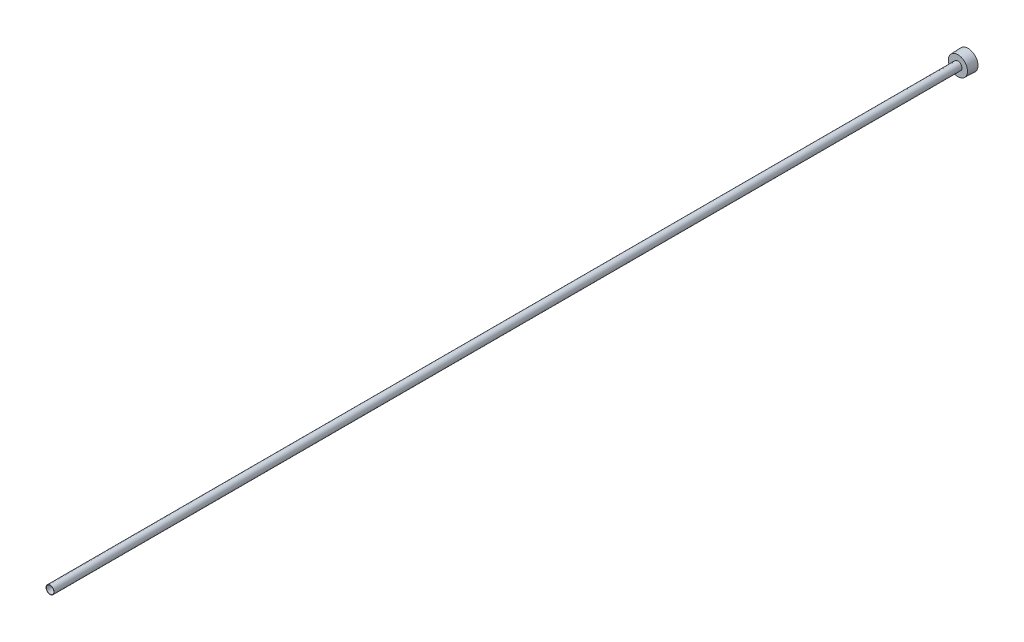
ISO-10303-21;
HEADER;
FILE_DESCRIPTION(('STEP AP214'),'2;1');
FILE_NAME('part.step','',(''),(''),'','','');
FILE_SCHEMA(('AUTOMOTIVE_DESIGN { 1 0 10303 214 1 1 1 1 }'));
ENDSEC;
DATA;
#1=APPLICATION_CONTEXT('core data for automotive mechanical design processes');
#2=APPLICATION_PROTOCOL_DEFINITION('international standard','automotive_design',2000,#1);
#3=PRODUCT_CONTEXT('',#1,'mechanical');
#4=PRODUCT('Part','Part','',(#3));
#5=PRODUCT_RELATED_PRODUCT_CATEGORY('part','',(#4));
#6=PRODUCT_DEFINITION_FORMATION('','',#4);
#7=PRODUCT_DEFINITION_CONTEXT('part definition',#1,'design');
#8=PRODUCT_DEFINITION('design','',#6,#7);
#9=PRODUCT_DEFINITION_SHAPE('','',#8);
#10=(LENGTH_UNIT() NAMED_UNIT(*) SI_UNIT(.MILLI.,.METRE.));
#11=(NAMED_UNIT(*) PLANE_ANGLE_UNIT() SI_UNIT($,.RADIAN.));
#12=(NAMED_UNIT(*) SI_UNIT($,.STERADIAN.) SOLID_ANGLE_UNIT());
#13=UNCERTAINTY_MEASURE_WITH_UNIT(LENGTH_MEASURE(1.E-05),#10,'distance_accuracy_value','');
#14=(GEOMETRIC_REPRESENTATION_CONTEXT(3) GLOBAL_UNCERTAINTY_ASSIGNED_CONTEXT((#13)) GLOBAL_UNIT_ASSIGNED_CONTEXT((#10,
#11,#12)) REPRESENTATION_CONTEXT('',''));
#15=CARTESIAN_POINT('',(0.,0.,0.));
#16=DIRECTION('',(0.,0.,1.));
#17=DIRECTION('',(1.,0.,0.));
#18=AXIS2_PLACEMENT_3D('',#15,#16,#17);
#19=CARTESIAN_POINT('',(0.,0.,0.));
#20=DIRECTION('',(0.,0.,1.));
#21=DIRECTION('',(1.,0.,0.));
#22=AXIS2_PLACEMENT_3D('',#19,#20,#21);
#23=CYLINDRICAL_SURFACE('',#22,5.0419);
#24=CARTESIAN_POINT('',(0.,0.,1219.2));
#25=DIRECTION('',(0.,0.,1.));
#26=DIRECTION('',(1.,0.,0.));
#27=AXIS2_PLACEMENT_3D('',#24,#25,#26);
#28=CIRCLE('',#27,5.0419);
#29=CARTESIAN_POINT('',(5.0419,0.,1219.2));
#30=VERTEX_POINT('',#29);
#31=EDGE_CURVE('E141',#30,#30,#28,.T.);
#32=CARTESIAN_POINT('',(0.,0.,9.525));
#33=DIRECTION('',(0.,0.,-1.));
#34=DIRECTION('',(-1.,0.,0.));
#35=AXIS2_PLACEMENT_3D('',#32,#33,#34);
#36=CIRCLE('',#35,5.0419);
#37=CARTESIAN_POINT('',(5.0419,0.,9.525));
#38=VERTEX_POINT('',#37);
#39=EDGE_CURVE('E36',#38,#38,#36,.F.);
#40=CARTESIAN_POINT('',(5.0419,0.,1219.2));
#41=CARTESIAN_POINT('',(5.0419,0.,1206.59921875));
#42=CARTESIAN_POINT('',(5.0419,0.,1193.9984375));
#43=CARTESIAN_POINT('',(5.0419,0.,1168.796875));
#44=CARTESIAN_POINT('',(5.0419,0.,1156.19609375));
#45=CARTESIAN_POINT('',(5.0419,0.,1130.99453125));
#46=CARTESIAN_POINT('',(5.0419,0.,1118.39375));
#47=CARTESIAN_POINT('',(5.0419,0.,1093.1921875));
#48=CARTESIAN_POINT('',(5.0419,0.,1080.59140625));
#49=CARTESIAN_POINT('',(5.0419,0.,1055.38984375));
#50=CARTESIAN_POINT('',(5.0419,0.,1042.7890625));
#51=CARTESIAN_POINT('',(5.0419,0.,1017.5875));
#52=CARTESIAN_POINT('',(5.0419,0.,1004.98671875));
#53=CARTESIAN_POINT('',(5.0419,0.,979.78515625));
#54=CARTESIAN_POINT('',(5.0419,0.,967.184375));
#55=CARTESIAN_POINT('',(5.0419,0.,941.9828125));
#56=CARTESIAN_POINT('',(5.0419,0.,929.38203125));
#57=CARTESIAN_POINT('',(5.0419,0.,904.18046875));
#58=CARTESIAN_POINT('',(5.0419,0.,891.5796875));
#59=CARTESIAN_POINT('',(5.0419,0.,866.378125));
#60=CARTESIAN_POINT('',(5.0419,0.,853.77734375));
#61=CARTESIAN_POINT('',(5.0419,0.,828.57578125));
#62=CARTESIAN_POINT('',(5.0419,0.,815.975));
#63=CARTESIAN_POINT('',(5.0419,0.,790.7734375));
#64=CARTESIAN_POINT('',(5.0419,0.,778.17265625));
#65=CARTESIAN_POINT('',(5.0419,0.,752.97109375));
#66=CARTESIAN_POINT('',(5.0419,0.,740.3703125));
#67=CARTESIAN_POINT('',(5.0419,0.,715.16875));
#68=CARTESIAN_POINT('',(5.0419,0.,702.56796875));
#69=CARTESIAN_POINT('',(5.0419,0.,677.36640625));
#70=CARTESIAN_POINT('',(5.0419,0.,664.765625));
#71=CARTESIAN_POINT('',(5.0419,0.,639.5640625));
#72=CARTESIAN_POINT('',(5.0419,0.,626.96328125));
#73=CARTESIAN_POINT('',(5.0419,0.,601.76171875));
#74=CARTESIAN_POINT('',(5.0419,0.,589.1609375));
#75=CARTESIAN_POINT('',(5.0419,0.,563.959375));
#76=CARTESIAN_POINT('',(5.0419,0.,551.35859375));
#77=CARTESIAN_POINT('',(5.0419,0.,526.15703125));
#78=CARTESIAN_POINT('',(5.0419,0.,513.55625));
#79=CARTESIAN_POINT('',(5.0419,0.,488.3546875));
#80=CARTESIAN_POINT('',(5.0419,0.,475.75390625));
#81=CARTESIAN_POINT('',(5.0419,0.,450.55234375));
#82=CARTESIAN_POINT('',(5.0419,0.,437.9515625));
#83=CARTESIAN_POINT('',(5.0419,0.,412.75));
#84=CARTESIAN_POINT('',(5.0419,0.,400.14921875));
#85=CARTESIAN_POINT('',(5.0419,0.,374.94765625));
#86=CARTESIAN_POINT('',(5.0419,0.,362.346875));
#87=CARTESIAN_POINT('',(5.0419,0.,337.1453125));
#88=CARTESIAN_POINT('',(5.0419,0.,324.54453125));
#89=CARTESIAN_POINT('',(5.0419,0.,299.34296875));
#90=CARTESIAN_POINT('',(5.0419,0.,286.7421875));
#91=CARTESIAN_POINT('',(5.0419,0.,261.540625));
#92=CARTESIAN_POINT('',(5.0419,0.,248.93984375));
#93=CARTESIAN_POINT('',(5.0419,0.,223.73828125));
#94=CARTESIAN_POINT('',(5.0419,0.,211.1375));
#95=CARTESIAN_POINT('',(5.0419,0.,185.9359375));
#96=CARTESIAN_POINT('',(5.0419,0.,173.33515625));
#97=CARTESIAN_POINT('',(5.0419,0.,148.13359375));
#98=CARTESIAN_POINT('',(5.0419,0.,135.5328125));
#99=CARTESIAN_POINT('',(5.0419,0.,110.33125));
#100=CARTESIAN_POINT('',(5.0419,0.,97.73046875));
#101=CARTESIAN_POINT('',(5.0419,0.,72.52890625));
#102=CARTESIAN_POINT('',(5.0419,0.,59.928125));
#103=CARTESIAN_POINT('',(5.0419,0.,34.7265624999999));
#104=CARTESIAN_POINT('',(5.0419,0.,22.12578125));
#105=CARTESIAN_POINT('',(5.0419,0.,9.525));
#106=B_SPLINE_CURVE_WITH_KNOTS('',3,(#40,#41,#42,#43,#44,#45,#46,#47,#48,#49,#50,#51,#52,#53,
#54,#55,#56,#57,#58,#59,#60,#61,#62,#63,#64,#65,#66,#67,#68,#69,#70,#71,#72,#73,#74,#75,#76,#77,
#78,#79,#80,#81,#82,#83,#84,#85,#86,#87,#88,#89,#90,#91,#92,#93,#94,#95,#96,#97,#98,#99,#100,
#101,#102,#103,#104,#105),.UNSPECIFIED.,.F.,.F.,(4,2,2,2,2,2,2,2,2,2,2,2,2,2,2,2,2,2,2,2,2,2,2,
2,2,2,2,2,2,2,2,2,4),(0.,37.8023437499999,75.6046875,113.40703125,151.209375,189.01171875,
226.8140625,264.61640625,302.41875,340.22109375,378.0234375,415.82578125,453.628125,
491.43046875,529.2328125,567.03515625,604.8375,642.63984375,680.4421875,718.24453125,756.046875,
793.84921875,831.6515625,869.45390625,907.25625,945.05859375,982.8609375,1020.66328125,
1058.465625,1096.26796875,1134.0703125,1171.87265625,1209.675),.UNSPECIFIED.);
#107=EDGE_CURVE('BSEAM32',#30,#38,#106,.T.);
#108=ORIENTED_EDGE('',*,*,#31,.T.);
#109=ORIENTED_EDGE('',*,*,#39,.F.);
#110=ORIENTED_EDGE('',*,*,#107,.T.);
#111=ORIENTED_EDGE('',*,*,#107,.F.);
#112=EDGE_LOOP('',(#108,#110,#109,#111));
#113=FACE_BOUND('',#112,.T.);
#114=ADVANCED_FACE('F32',(#113),#23,.F.);
#115=CARTESIAN_POINT('',(0.,5.42289999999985,1219.2));
#116=DIRECTION('',(0.,0.,-1.));
#117=DIRECTION('',(-1.,0.,0.));
#118=AXIS2_PLACEMENT_3D('',#115,#116,#117);
#119=PLANE('',#118);
#120=ORIENTED_EDGE('',*,*,#31,.F.);
#121=EDGE_LOOP('',(#120));
#122=FACE_BOUND('',#121,.T.);
#123=CARTESIAN_POINT('',(0.,0.,1219.2));
#124=DIRECTION('',(0.,0.,1.));
#125=DIRECTION('',(1.,0.,0.));
#126=AXIS2_PLACEMENT_3D('',#123,#124,#125);
#127=CIRCLE('',#126,5.42289999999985);
#128=CARTESIAN_POINT('',(5.42289999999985,0.,1219.2));
#129=VERTEX_POINT('',#128);
#130=EDGE_CURVE('E144',#129,#129,#127,.T.);
#131=ORIENTED_EDGE('',*,*,#130,.T.);
#132=EDGE_LOOP('',(#131));
#133=FACE_BOUND('',#132,.T.);
#134=ADVANCED_FACE('F34',(#122,#133),#119,.F.);
#135=CARTESIAN_POINT('',(0.,0.,0.));
#136=DIRECTION('',(0.,0.,1.));
#137=DIRECTION('',(1.,0.,0.));
#138=AXIS2_PLACEMENT_3D('',#135,#136,#137);
#139=PLANE('',#138);
#140=DIRECTION('',(-0.866025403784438,0.5,0.));
#141=VECTOR('',#140,1.);
#142=CARTESIAN_POINT('',(0.,-10.9985226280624,0.));
#143=LINE('',#142,#141);
#144=CARTESIAN_POINT('',(0.,-10.9985226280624,0.));
#145=VERTEX_POINT('',#144);
#146=CARTESIAN_POINT('',(-9.525,-5.49926131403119,0.));
#147=VERTEX_POINT('',#146);
#148=EDGE_CURVE('E123',#145,#147,#143,.T.);
#149=ORIENTED_EDGE('',*,*,#148,.F.);
#150=DIRECTION('',(-0.866025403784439,-0.5,0.));
#151=VECTOR('',#150,1.);
#152=CARTESIAN_POINT('',(9.525,-5.49926131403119,0.));
#153=LINE('',#152,#151);
#154=CARTESIAN_POINT('',(9.525,-5.49926131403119,0.));
#155=VERTEX_POINT('',#154);
#156=EDGE_CURVE('E48',#155,#145,#153,.T.);
#157=ORIENTED_EDGE('',*,*,#156,.F.);
#158=DIRECTION('',(0.,-1.,0.));
#159=VECTOR('',#158,1.);
#160=CARTESIAN_POINT('',(9.525,5.49926131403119,0.));
#161=LINE('',#160,#159);
#162=CARTESIAN_POINT('',(9.525,5.49926131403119,0.));
#163=VERTEX_POINT('',#162);
#164=EDGE_CURVE('E132',#163,#155,#161,.T.);
#165=ORIENTED_EDGE('',*,*,#164,.F.);
#166=DIRECTION('',(0.866025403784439,-0.5,0.));
#167=VECTOR('',#166,1.);
#168=CARTESIAN_POINT('',(0.,10.9985226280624,0.));
#169=LINE('',#168,#167);
#170=CARTESIAN_POINT('',(0.,10.9985226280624,0.));
#171=VERTEX_POINT('',#170);
#172=EDGE_CURVE('E130',#171,#163,#169,.T.);
#173=ORIENTED_EDGE('',*,*,#172,.F.);
#174=DIRECTION('',(0.866025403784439,0.5,0.));
#175=VECTOR('',#174,1.);
#176=CARTESIAN_POINT('',(-9.525,5.49926131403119,0.));
#177=LINE('',#176,#175);
#178=CARTESIAN_POINT('',(-9.525,5.49926131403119,0.));
#179=VERTEX_POINT('',#178);
#180=EDGE_CURVE('E96',#179,#171,#177,.T.);
#181=ORIENTED_EDGE('',*,*,#180,.F.);
#182=DIRECTION('',(0.,1.,0.));
#183=VECTOR('',#182,1.);
#184=CARTESIAN_POINT('',(-9.525,-5.49926131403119,0.));
#185=LINE('',#184,#183);
#186=EDGE_CURVE('E126',#147,#179,#185,.T.);
#187=ORIENTED_EDGE('',*,*,#186,.F.);
#188=EDGE_LOOP('',(#149,#157,#165,#173,#181,#187));
#189=FACE_BOUND('',#188,.T.);
#190=CARTESIAN_POINT('',(0.,0.,0.));
#191=DIRECTION('',(0.,0.,1.));
#192=DIRECTION('',(1.,0.,0.));
#193=AXIS2_PLACEMENT_3D('',#190,#191,#192);
#194=CIRCLE('',#193,13.2207);
#195=CARTESIAN_POINT('',(13.2207,0.,0.));
#196=VERTEX_POINT('',#195);
#197=EDGE_CURVE('E11',#196,#196,#194,.T.);
#198=ORIENTED_EDGE('',*,*,#197,.F.);
#199=EDGE_LOOP('',(#198));
#200=FACE_BOUND('',#199,.T.);
#201=ADVANCED_FACE('F158',(#189,#200),#139,.F.);
#202=CARTESIAN_POINT('',(0.,0.,0.));
#203=DIRECTION('',(0.,0.,-1.));
#204=DIRECTION('',(-1.,0.,0.));
#205=AXIS2_PLACEMENT_3D('',#202,#203,#204);
#206=CONICAL_SURFACE('',#205,13.2207,0.0364599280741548);
#207=CARTESIAN_POINT('',(0.,0.,13.4874));
#208=DIRECTION('',(0.,0.,1.));
#209=DIRECTION('',(1.,0.,0.));
#210=AXIS2_PLACEMENT_3D('',#207,#208,#209);
#211=CIRCLE('',#210,12.7287323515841);
#212=CARTESIAN_POINT('',(12.7287323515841,0.,13.4874));
#213=VERTEX_POINT('',#212);
#214=EDGE_CURVE('E41',#213,#213,#211,.T.);
#215=ORIENTED_EDGE('',*,*,#214,.F.);
#216=EDGE_LOOP('',(#215));
#217=FACE_BOUND('',#216,.T.);
#218=ORIENTED_EDGE('',*,*,#197,.T.);
#219=EDGE_LOOP('',(#218));
#220=FACE_BOUND('',#219,.T.);
#221=ADVANCED_FACE('F155',(#217,#220),#206,.T.);
#222=CARTESIAN_POINT('',(0.,12.7287323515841,13.4874));
#223=DIRECTION('',(0.,0.,-1.));
#224=DIRECTION('',(-1.,0.,0.));
#225=AXIS2_PLACEMENT_3D('',#222,#223,#224);
#226=PLANE('',#225);
#227=CARTESIAN_POINT('',(0.,0.,13.4874));
#228=DIRECTION('',(0.,0.,1.));
#229=DIRECTION('',(1.,0.,0.));
#230=AXIS2_PLACEMENT_3D('',#227,#228,#229);
#231=CIRCLE('',#230,5.4229);
#232=CARTESIAN_POINT('',(5.4229,0.,13.4874));
#233=VERTEX_POINT('',#232);
#234=EDGE_CURVE('E147',#233,#233,#231,.T.);
#235=ORIENTED_EDGE('',*,*,#234,.F.);
#236=EDGE_LOOP('',(#235));
#237=FACE_BOUND('',#236,.T.);
#238=ORIENTED_EDGE('',*,*,#214,.T.);
#239=EDGE_LOOP('',(#238));
#240=FACE_BOUND('',#239,.T.);
#241=ADVANCED_FACE('F153',(#237,#240),#226,.F.);
#242=CARTESIAN_POINT('',(0.,0.,278.00111462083));
#243=DIRECTION('',(0.,0.,1.));
#244=DIRECTION('',(1.,0.,0.));
#245=AXIS2_PLACEMENT_3D('',#242,#243,#244);
#246=CYLINDRICAL_SURFACE('',#245,5.42289999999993);
#247=ORIENTED_EDGE('',*,*,#130,.F.);
#248=EDGE_LOOP('',(#247));
#249=FACE_BOUND('',#248,.T.);
#250=ORIENTED_EDGE('',*,*,#234,.T.);
#251=EDGE_LOOP('',(#250));
#252=FACE_BOUND('',#251,.T.);
#253=ADVANCED_FACE('F179',(#249,#252),#246,.T.);
#254=CARTESIAN_POINT('',(0.,-10.9985226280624,9.525));
#255=DIRECTION('',(0.,0.,-1.));
#256=DIRECTION('',(-1.,0.,0.));
#257=AXIS2_PLACEMENT_3D('',#254,#255,#256);
#258=PLANE('',#257);
#259=DIRECTION('',(-0.866025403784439,-0.5,0.));
#260=VECTOR('',#259,1.);
#261=CARTESIAN_POINT('',(9.525,-5.49926131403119,9.525));
#262=LINE('',#261,#260);
#263=CARTESIAN_POINT('',(9.525,-5.49926131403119,9.525));
#264=VERTEX_POINT('',#263);
#265=CARTESIAN_POINT('',(0.,-10.9985226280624,9.525));
#266=VERTEX_POINT('',#265);
#267=EDGE_CURVE('E134',#264,#266,#262,.T.);
#268=ORIENTED_EDGE('',*,*,#267,.T.);
#269=DIRECTION('',(-0.866025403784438,0.5,0.));
#270=VECTOR('',#269,1.);
#271=CARTESIAN_POINT('',(0.,-10.9985226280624,9.525));
#272=LINE('',#271,#270);
#273=CARTESIAN_POINT('',(-9.525,-5.49926131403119,9.525));
#274=VERTEX_POINT('',#273);
#275=EDGE_CURVE('E117',#266,#274,#272,.T.);
#276=ORIENTED_EDGE('',*,*,#275,.T.);
#277=DIRECTION('',(0.,1.,0.));
#278=VECTOR('',#277,1.);
#279=CARTESIAN_POINT('',(-9.525,-5.49926131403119,9.525));
#280=LINE('',#279,#278);
#281=CARTESIAN_POINT('',(-9.525,5.49926131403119,9.525));
#282=VERTEX_POINT('',#281);
#283=EDGE_CURVE('E115',#274,#282,#280,.T.);
#284=ORIENTED_EDGE('',*,*,#283,.T.);
#285=DIRECTION('',(0.866025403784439,0.5,0.));
#286=VECTOR('',#285,1.);
#287=CARTESIAN_POINT('',(-9.525,5.49926131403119,9.525));
#288=LINE('',#287,#286);
#289=CARTESIAN_POINT('',(0.,10.9985226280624,9.525));
#290=VERTEX_POINT('',#289);
#291=EDGE_CURVE('E93',#282,#290,#288,.T.);
#292=ORIENTED_EDGE('',*,*,#291,.T.);
#293=DIRECTION('',(0.866025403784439,-0.5,0.));
#294=VECTOR('',#293,1.);
#295=CARTESIAN_POINT('',(0.,10.9985226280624,9.525));
#296=LINE('',#295,#294);
#297=CARTESIAN_POINT('',(9.525,5.49926131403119,9.525));
#298=VERTEX_POINT('',#297);
#299=EDGE_CURVE('E104',#290,#298,#296,.T.);
#300=ORIENTED_EDGE('',*,*,#299,.T.);
#301=DIRECTION('',(0.,-1.,0.));
#302=VECTOR('',#301,1.);
#303=CARTESIAN_POINT('',(9.525,5.49926131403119,9.525));
#304=LINE('',#303,#302);
#305=EDGE_CURVE('E108',#298,#264,#304,.T.);
#306=ORIENTED_EDGE('',*,*,#305,.T.);
#307=EDGE_LOOP('',(#268,#276,#284,#292,#300,#306));
#308=FACE_BOUND('',#307,.T.);
#309=ORIENTED_EDGE('',*,*,#39,.T.);
#310=EDGE_LOOP('',(#309));
#311=FACE_BOUND('',#310,.T.);
#312=ADVANCED_FACE('F111',(#308,#311),#258,.T.);
#313=CARTESIAN_POINT('',(9.525,-5.49926131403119,9.525));
#314=DIRECTION('',(0.5,-0.866025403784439,0.));
#315=DIRECTION('',(0.866025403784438,0.5,0.));
#316=AXIS2_PLACEMENT_3D('',#313,#314,#315);
#317=PLANE('',#316);
#318=ORIENTED_EDGE('',*,*,#156,.T.);
#319=DIRECTION('',(0.,0.,-1.));
#320=VECTOR('',#319,1.);
#321=CARTESIAN_POINT('',(0.,-10.9985226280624,9.525));
#322=LINE('',#321,#320);
#323=EDGE_CURVE('E78',#266,#145,#322,.T.);
#324=ORIENTED_EDGE('',*,*,#323,.F.);
#325=ORIENTED_EDGE('',*,*,#267,.F.);
#326=DIRECTION('',(0.,0.,-1.));
#327=VECTOR('',#326,1.);
#328=CARTESIAN_POINT('',(9.525,-5.49926131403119,9.525));
#329=LINE('',#328,#327);
#330=EDGE_CURVE('E56',#264,#155,#329,.T.);
#331=ORIENTED_EDGE('',*,*,#330,.T.);
#332=EDGE_LOOP('',(#318,#324,#325,#331));
#333=FACE_BOUND('',#332,.T.);
#334=ADVANCED_FACE('F177',(#333),#317,.F.);
#335=CARTESIAN_POINT('',(9.525,5.49926131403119,9.525));
#336=DIRECTION('',(1.,0.,0.));
#337=DIRECTION('',(0.,0.,-1.));
#338=AXIS2_PLACEMENT_3D('',#335,#336,#337);
#339=PLANE('',#338);
#340=ORIENTED_EDGE('',*,*,#164,.T.);
#341=ORIENTED_EDGE('',*,*,#330,.F.);
#342=ORIENTED_EDGE('',*,*,#305,.F.);
#343=DIRECTION('',(0.,0.,-1.));
#344=VECTOR('',#343,1.);
#345=CARTESIAN_POINT('',(9.525,5.49926131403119,9.525));
#346=LINE('',#345,#344);
#347=EDGE_CURVE('E100',#298,#163,#346,.T.);
#348=ORIENTED_EDGE('',*,*,#347,.T.);
#349=EDGE_LOOP('',(#340,#341,#342,#348));
#350=FACE_BOUND('',#349,.T.);
#351=ADVANCED_FACE('F208',(#350),#339,.F.);
#352=CARTESIAN_POINT('',(0.,10.9985226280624,9.525));
#353=DIRECTION('',(0.5,0.866025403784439,0.));
#354=DIRECTION('',(-0.866025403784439,0.5,0.));
#355=AXIS2_PLACEMENT_3D('',#352,#353,#354);
#356=PLANE('',#355);
#357=ORIENTED_EDGE('',*,*,#172,.T.);
#358=ORIENTED_EDGE('',*,*,#347,.F.);
#359=ORIENTED_EDGE('',*,*,#299,.F.);
#360=DIRECTION('',(0.,0.,-1.));
#361=VECTOR('',#360,1.);
#362=CARTESIAN_POINT('',(0.,10.9985226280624,9.525));
#363=LINE('',#362,#361);
#364=EDGE_CURVE('E89',#290,#171,#363,.T.);
#365=ORIENTED_EDGE('',*,*,#364,.T.);
#366=EDGE_LOOP('',(#357,#358,#359,#365));
#367=FACE_BOUND('',#366,.T.);
#368=ADVANCED_FACE('F105',(#367),#356,.F.);
#369=CARTESIAN_POINT('',(-9.525,5.49926131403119,9.525));
#370=DIRECTION('',(-0.5,0.866025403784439,0.));
#371=DIRECTION('',(-0.866025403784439,-0.5,0.));
#372=AXIS2_PLACEMENT_3D('',#369,#370,#371);
#373=PLANE('',#372);
#374=ORIENTED_EDGE('',*,*,#180,.T.);
#375=ORIENTED_EDGE('',*,*,#364,.F.);
#376=ORIENTED_EDGE('',*,*,#291,.F.);
#377=DIRECTION('',(0.,0.,-1.));
#378=VECTOR('',#377,1.);
#379=CARTESIAN_POINT('',(-9.525,5.49926131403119,9.525));
#380=LINE('',#379,#378);
#381=EDGE_CURVE('E101',#282,#179,#380,.T.);
#382=ORIENTED_EDGE('',*,*,#381,.T.);
#383=EDGE_LOOP('',(#374,#375,#376,#382));
#384=FACE_BOUND('',#383,.T.);
#385=ADVANCED_FACE('F91',(#384),#373,.F.);
#386=CARTESIAN_POINT('',(-9.525,-5.49926131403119,9.525));
#387=DIRECTION('',(-1.,0.,0.));
#388=DIRECTION('',(0.,-1.,0.));
#389=AXIS2_PLACEMENT_3D('',#386,#387,#388);
#390=PLANE('',#389);
#391=ORIENTED_EDGE('',*,*,#186,.T.);
#392=ORIENTED_EDGE('',*,*,#381,.F.);
#393=ORIENTED_EDGE('',*,*,#283,.F.);
#394=DIRECTION('',(0.,0.,-1.));
#395=VECTOR('',#394,1.);
#396=CARTESIAN_POINT('',(-9.525,-5.49926131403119,9.525));
#397=LINE('',#396,#395);
#398=EDGE_CURVE('E138',#274,#147,#397,.T.);
#399=ORIENTED_EDGE('',*,*,#398,.T.);
#400=EDGE_LOOP('',(#391,#392,#393,#399));
#401=FACE_BOUND('',#400,.T.);
#402=ADVANCED_FACE('F226',(#401),#390,.F.);
#403=CARTESIAN_POINT('',(0.,-10.9985226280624,9.525));
#404=DIRECTION('',(-0.5,-0.866025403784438,0.));
#405=DIRECTION('',(0.866025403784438,-0.5,0.));
#406=AXIS2_PLACEMENT_3D('',#403,#404,#405);
#407=PLANE('',#406);
#408=ORIENTED_EDGE('',*,*,#148,.T.);
#409=ORIENTED_EDGE('',*,*,#398,.F.);
#410=ORIENTED_EDGE('',*,*,#275,.F.);
#411=ORIENTED_EDGE('',*,*,#323,.T.);
#412=EDGE_LOOP('',(#408,#409,#410,#411));
#413=FACE_BOUND('',#412,.T.);
#414=ADVANCED_FACE('F233',(#413),#407,.F.);
#415=CLOSED_SHELL('',(#114,#134,#201,#221,#241,#253,#312,#334,#351,#368,#385,#402,#414));
#416=MANIFOLD_SOLID_BREP('B2',#415);
#417=ADVANCED_BREP_SHAPE_REPRESENTATION('',(#18,#416),#14);
#418=SHAPE_DEFINITION_REPRESENTATION(#9,#417);
ENDSEC;
END-ISO-10303-21;
